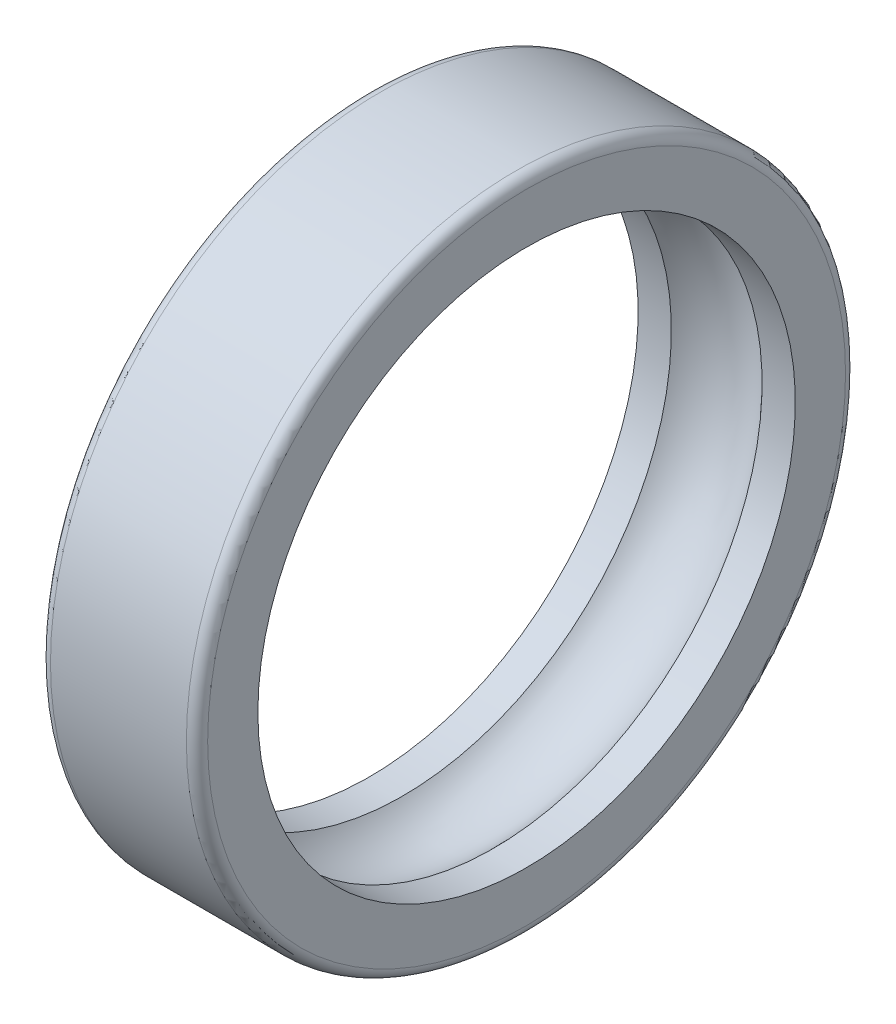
from build123d import *

# Parameters (mm, degrees)
FILLET1_R = 2.1


with BuildPart() as part:
    # Sketch1 → Revolve2 (revolve)
    with BuildSketch(Plane.XY, mode=Mode.PRIVATE) as revolve2_sk:
        with BuildLine():
            Line((-15.5, 53), (-8.94427191, 53))
            ThreePointArc((-8.94427191, 53), (0, 57), (8.94427191, 53))
            Line((8.94427191, 53), (15.5, 53))
            Line((15.5, 53), (15.5, 65))
            Line((15.5, 65), (-15.5, 65))
            Line((-15.5, 65), (-15.5, 53))
        make_face()
    revolve(revolve2_sk.sketch.rotate(Axis((-9.504115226, 0, 0), (1, 0, 0)), 90), axis=Axis((-9.504115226, 0, 0), (1, 0, 0)))

    # Fillet1
    fillet1_edges = [part.edges().sort_by_distance(p)[0] for p in [
        (-15.5, 0, -65),
        (15.5, 0, -65),
    ]]
    fillet(fillet1_edges, radius=FILLET1_R)


solid = part.part
